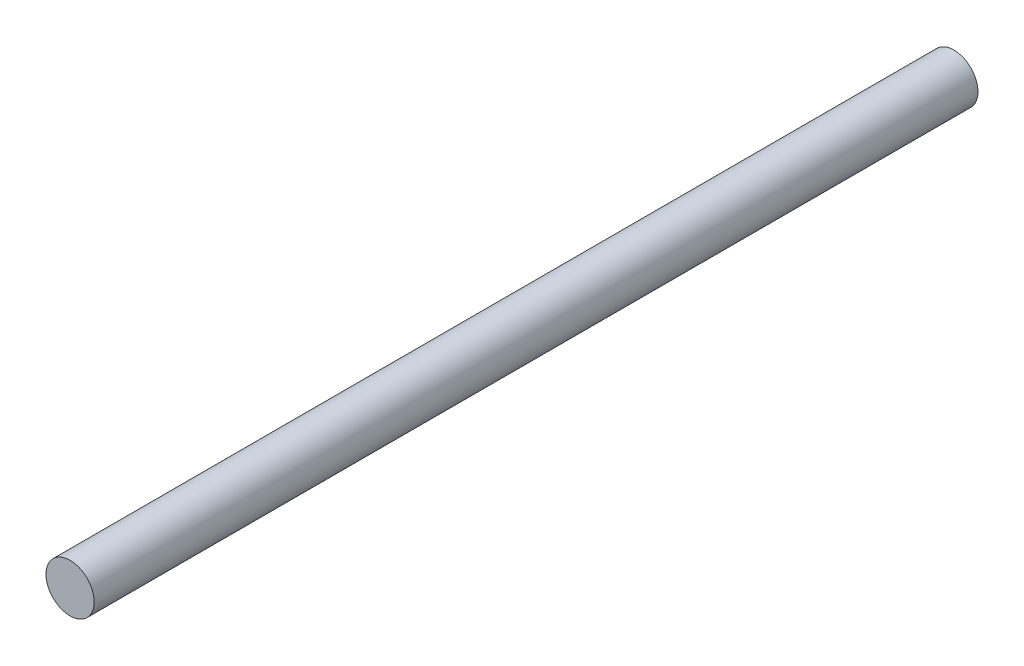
from build123d import *

# Parameters (mm, degrees)
SKETCH1_R      = 0.381
EXTRUDE1_DEPTH = 13.97


with BuildPart() as part:
    # Sketch1 → Extrude1 (new body)
    with BuildSketch(Plane.XY):
        Circle(SKETCH1_R)
    extrude(amount=EXTRUDE1_DEPTH)


solid = part.part
